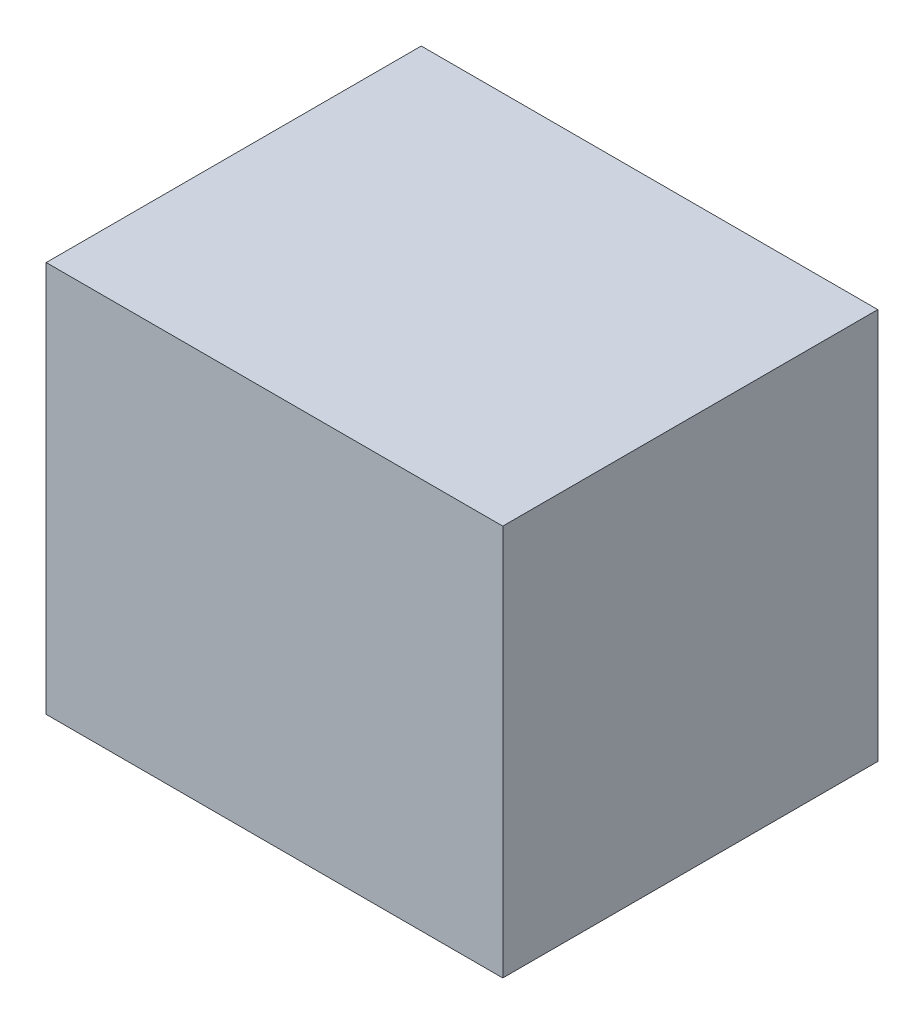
ISO-10303-21;
HEADER;
FILE_DESCRIPTION(('STEP AP214'),'2;1');
FILE_NAME('part.step','',(''),(''),'','','');
FILE_SCHEMA(('AUTOMOTIVE_DESIGN { 1 0 10303 214 1 1 1 1 }'));
ENDSEC;
DATA;
#1=APPLICATION_CONTEXT('core data for automotive mechanical design processes');
#2=APPLICATION_PROTOCOL_DEFINITION('international standard','automotive_design',2000,#1);
#3=PRODUCT_CONTEXT('',#1,'mechanical');
#4=PRODUCT('Part','Part','',(#3));
#5=PRODUCT_RELATED_PRODUCT_CATEGORY('part','',(#4));
#6=PRODUCT_DEFINITION_FORMATION('','',#4);
#7=PRODUCT_DEFINITION_CONTEXT('part definition',#1,'design');
#8=PRODUCT_DEFINITION('design','',#6,#7);
#9=PRODUCT_DEFINITION_SHAPE('','',#8);
#10=(LENGTH_UNIT() NAMED_UNIT(*) SI_UNIT(.MILLI.,.METRE.));
#11=(NAMED_UNIT(*) PLANE_ANGLE_UNIT() SI_UNIT($,.RADIAN.));
#12=(NAMED_UNIT(*) SI_UNIT($,.STERADIAN.) SOLID_ANGLE_UNIT());
#13=UNCERTAINTY_MEASURE_WITH_UNIT(LENGTH_MEASURE(1.E-05),#10,'distance_accuracy_value','');
#14=(GEOMETRIC_REPRESENTATION_CONTEXT(3) GLOBAL_UNCERTAINTY_ASSIGNED_CONTEXT((#13)) GLOBAL_UNIT_ASSIGNED_CONTEXT((#10,
#11,#12)) REPRESENTATION_CONTEXT('',''));
#15=CARTESIAN_POINT('',(0.,0.,0.));
#16=DIRECTION('',(0.,0.,1.));
#17=DIRECTION('',(1.,0.,0.));
#18=AXIS2_PLACEMENT_3D('',#15,#16,#17);
#19=CARTESIAN_POINT('',(35.5842076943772,-86.6168743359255,-12.8832886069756));
#20=DIRECTION('',(1.,0.,0.));
#21=DIRECTION('',(0.,0.,-1.));
#22=AXIS2_PLACEMENT_3D('',#19,#20,#21);
#23=PLANE('',#22);
#24=DIRECTION('',(0.,0.,1.));
#25=VECTOR('',#24,1.);
#26=CARTESIAN_POINT('',(35.5842076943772,-134.616874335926,-12.8832886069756));
#27=LINE('',#26,#25);
#28=CARTESIAN_POINT('',(35.5842076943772,-134.616874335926,-12.8832886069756));
#29=VERTEX_POINT('',#28);
#30=CARTESIAN_POINT('',(35.5842076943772,-134.616874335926,33.1167113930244));
#31=VERTEX_POINT('',#30);
#32=EDGE_CURVE('E100',#29,#31,#27,.T.);
#33=ORIENTED_EDGE('',*,*,#32,.T.);
#34=DIRECTION('',(0.,-1.,0.));
#35=VECTOR('',#34,1.);
#36=CARTESIAN_POINT('',(35.5842076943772,-86.6168743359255,33.1167113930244));
#37=LINE('',#36,#35);
#38=CARTESIAN_POINT('',(35.5842076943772,-86.6168743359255,33.1167113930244));
#39=VERTEX_POINT('',#38);
#40=EDGE_CURVE('E11',#39,#31,#37,.T.);
#41=ORIENTED_EDGE('',*,*,#40,.F.);
#42=DIRECTION('',(0.,0.,1.));
#43=VECTOR('',#42,1.);
#44=CARTESIAN_POINT('',(35.5842076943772,-86.6168743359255,-12.8832886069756));
#45=LINE('',#44,#43);
#46=CARTESIAN_POINT('',(35.5842076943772,-86.6168743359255,-12.8832886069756));
#47=VERTEX_POINT('',#46);
#48=EDGE_CURVE('E88',#47,#39,#45,.T.);
#49=ORIENTED_EDGE('',*,*,#48,.F.);
#50=DIRECTION('',(0.,-1.,0.));
#51=VECTOR('',#50,1.);
#52=CARTESIAN_POINT('',(35.5842076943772,-86.6168743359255,-12.8832886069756));
#53=LINE('',#52,#51);
#54=EDGE_CURVE('E96',#47,#29,#53,.T.);
#55=ORIENTED_EDGE('',*,*,#54,.T.);
#56=EDGE_LOOP('',(#33,#41,#49,#55));
#57=FACE_BOUND('',#56,.T.);
#58=ADVANCED_FACE('F37',(#57),#23,.F.);
#59=CARTESIAN_POINT('',(35.5842076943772,-86.6168743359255,33.1167113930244));
#60=DIRECTION('',(0.,0.,-1.));
#61=DIRECTION('',(-1.,0.,0.));
#62=AXIS2_PLACEMENT_3D('',#59,#60,#61);
#63=PLANE('',#62);
#64=DIRECTION('',(1.,0.,0.));
#65=VECTOR('',#64,1.);
#66=CARTESIAN_POINT('',(35.5842076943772,-134.616874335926,33.1167113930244));
#67=LINE('',#66,#65);
#68=CARTESIAN_POINT('',(91.5842076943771,-134.616874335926,33.1167113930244));
#69=VERTEX_POINT('',#68);
#70=EDGE_CURVE('E92',#31,#69,#67,.T.);
#71=ORIENTED_EDGE('',*,*,#70,.T.);
#72=DIRECTION('',(0.,-1.,0.));
#73=VECTOR('',#72,1.);
#74=CARTESIAN_POINT('',(91.5842076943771,-86.6168743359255,33.1167113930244));
#75=LINE('',#74,#73);
#76=CARTESIAN_POINT('',(91.5842076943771,-86.6168743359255,33.1167113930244));
#77=VERTEX_POINT('',#76);
#78=EDGE_CURVE('E45',#77,#69,#75,.T.);
#79=ORIENTED_EDGE('',*,*,#78,.F.);
#80=DIRECTION('',(1.,0.,0.));
#81=VECTOR('',#80,1.);
#82=CARTESIAN_POINT('',(35.5842076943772,-86.6168743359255,33.1167113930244));
#83=LINE('',#82,#81);
#84=EDGE_CURVE('E83',#39,#77,#83,.T.);
#85=ORIENTED_EDGE('',*,*,#84,.F.);
#86=ORIENTED_EDGE('',*,*,#40,.T.);
#87=EDGE_LOOP('',(#71,#79,#85,#86));
#88=FACE_BOUND('',#87,.T.);
#89=ADVANCED_FACE('F91',(#88),#63,.F.);
#90=CARTESIAN_POINT('',(91.5842076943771,-86.6168743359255,-12.8832886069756));
#91=DIRECTION('',(-1.,0.,0.));
#92=DIRECTION('',(0.,0.,1.));
#93=AXIS2_PLACEMENT_3D('',#90,#91,#92);
#94=PLANE('',#93);
#95=DIRECTION('',(0.,0.,-1.));
#96=VECTOR('',#95,1.);
#97=CARTESIAN_POINT('',(91.5842076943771,-134.616874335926,-12.8832886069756));
#98=LINE('',#97,#96);
#99=CARTESIAN_POINT('',(91.5842076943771,-134.616874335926,-12.8832886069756));
#100=VERTEX_POINT('',#99);
#101=EDGE_CURVE('E70',#69,#100,#98,.T.);
#102=ORIENTED_EDGE('',*,*,#101,.T.);
#103=DIRECTION('',(0.,-1.,0.));
#104=VECTOR('',#103,1.);
#105=CARTESIAN_POINT('',(91.5842076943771,-86.6168743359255,-12.8832886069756));
#106=LINE('',#105,#104);
#107=CARTESIAN_POINT('',(91.5842076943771,-86.6168743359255,-12.8832886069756));
#108=VERTEX_POINT('',#107);
#109=EDGE_CURVE('E93',#108,#100,#106,.T.);
#110=ORIENTED_EDGE('',*,*,#109,.F.);
#111=DIRECTION('',(0.,0.,-1.));
#112=VECTOR('',#111,1.);
#113=CARTESIAN_POINT('',(91.5842076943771,-86.6168743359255,-12.8832886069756));
#114=LINE('',#113,#112);
#115=EDGE_CURVE('E86',#77,#108,#114,.T.);
#116=ORIENTED_EDGE('',*,*,#115,.F.);
#117=ORIENTED_EDGE('',*,*,#78,.T.);
#118=EDGE_LOOP('',(#102,#110,#116,#117));
#119=FACE_BOUND('',#118,.T.);
#120=ADVANCED_FACE('F94',(#119),#94,.F.);
#121=CARTESIAN_POINT('',(35.5842076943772,-86.6168743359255,-12.8832886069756));
#122=DIRECTION('',(0.,0.,1.));
#123=DIRECTION('',(1.,0.,0.));
#124=AXIS2_PLACEMENT_3D('',#121,#122,#123);
#125=PLANE('',#124);
#126=DIRECTION('',(-1.,0.,0.));
#127=VECTOR('',#126,1.);
#128=CARTESIAN_POINT('',(35.5842076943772,-134.616874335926,-12.8832886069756));
#129=LINE('',#128,#127);
#130=EDGE_CURVE('E76',#100,#29,#129,.T.);
#131=ORIENTED_EDGE('',*,*,#130,.T.);
#132=ORIENTED_EDGE('',*,*,#54,.F.);
#133=DIRECTION('',(-1.,0.,0.));
#134=VECTOR('',#133,1.);
#135=CARTESIAN_POINT('',(35.5842076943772,-86.6168743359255,-12.8832886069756));
#136=LINE('',#135,#134);
#137=EDGE_CURVE('E53',#108,#47,#136,.T.);
#138=ORIENTED_EDGE('',*,*,#137,.F.);
#139=ORIENTED_EDGE('',*,*,#109,.T.);
#140=EDGE_LOOP('',(#131,#132,#138,#139));
#141=FACE_BOUND('',#140,.T.);
#142=ADVANCED_FACE('F107',(#141),#125,.F.);
#143=CARTESIAN_POINT('',(0.,-86.6168743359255,0.));
#144=DIRECTION('',(0.,1.,0.));
#145=DIRECTION('',(0.,0.,1.));
#146=AXIS2_PLACEMENT_3D('',#143,#144,#145);
#147=PLANE('',#146);
#148=ORIENTED_EDGE('',*,*,#48,.T.);
#149=ORIENTED_EDGE('',*,*,#84,.T.);
#150=ORIENTED_EDGE('',*,*,#115,.T.);
#151=ORIENTED_EDGE('',*,*,#137,.T.);
#152=EDGE_LOOP('',(#148,#149,#150,#151));
#153=FACE_BOUND('',#152,.T.);
#154=ADVANCED_FACE('F84',(#153),#147,.T.);
#155=CARTESIAN_POINT('',(0.,-134.616874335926,0.));
#156=DIRECTION('',(0.,1.,0.));
#157=DIRECTION('',(0.,0.,1.));
#158=AXIS2_PLACEMENT_3D('',#155,#156,#157);
#159=PLANE('',#158);
#160=ORIENTED_EDGE('',*,*,#32,.F.);
#161=ORIENTED_EDGE('',*,*,#130,.F.);
#162=ORIENTED_EDGE('',*,*,#101,.F.);
#163=ORIENTED_EDGE('',*,*,#70,.F.);
#164=EDGE_LOOP('',(#160,#161,#162,#163));
#165=FACE_BOUND('',#164,.T.);
#166=ADVANCED_FACE('F110',(#165),#159,.F.);
#167=CLOSED_SHELL('',(#58,#89,#120,#142,#154,#166));
#168=MANIFOLD_SOLID_BREP('B2',#167);
#169=ADVANCED_BREP_SHAPE_REPRESENTATION('',(#18,#168),#14);
#170=SHAPE_DEFINITION_REPRESENTATION(#9,#169);
ENDSEC;
END-ISO-10303-21;
